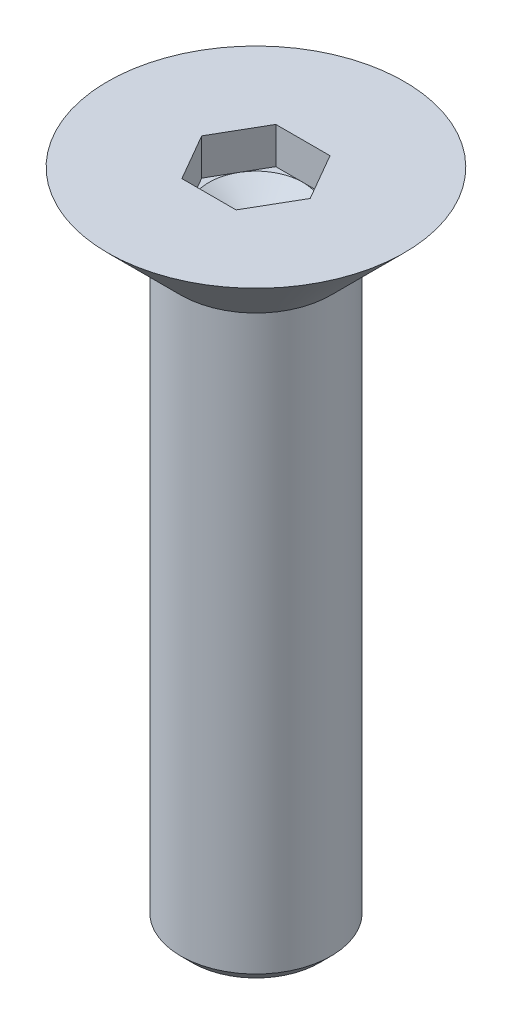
from build123d import *

# Parameters (mm, degrees)
ESQUISSE2_R             = 4
BASE_EXTRUSION_DEPTH    = 35
CHANFREIN1_SIZE         = 0.625
ESQUISSE7_R             = 2.5
ENL_V_MAT_EXTRU_2_DEPTH = 1.95
ENL_V_MAT_EXTRU_4_DEPTH = 1.95


with BuildPart() as part:
    # Esquisse2 → Base-Extrusion (new body)
    with BuildSketch(Plane(origin=(0, 0, 0), x_dir=(1, 0, 0), z_dir=(0, 1, 0))):
        with Locations(Location((0, 0, 0), (0, 0, 270))):
            Circle(ESQUISSE2_R)
    extrude(amount=-BASE_EXTRUSION_DEPTH)

    # Chanfrein1
    chanfrein1_edges = [part.edges().sort_by_distance(p)[0] for p in [
        (0, -35, -4),
    ]]
    chamfer(chanfrein1_edges, length=CHANFREIN1_SIZE)

    # Esquisse5 → Boss.-R_vol.1 (revolve)
    with BuildSketch(Plane.XY, mode=Mode.PRIVATE) as boss_r_vol_1_sk:
        Polygon((0, 0), (7.9, 0), (4, -3.9), (0, -3.9), align=None)
    revolve(boss_r_vol_1_sk.sketch.rotate(Axis((0, 0, 0), (0, -1, 0)), 90), axis=Axis((0, 0, 0), (0, -1, 0)))

    # Esquisse7 → Enl_v. mat.-Extru.2 (cut)
    with BuildSketch(Plane(origin=(0, 0, 0), x_dir=(-1, 0, 0), z_dir=(0, 1, 0))):
        Circle(ESQUISSE7_R)
    extrude(amount=-ENL_V_MAT_EXTRU_2_DEPTH, mode=Mode.SUBTRACT)

    # Enl_v. mat.-Extru.3 cone 1 section (on through the dimple's axis) → Enl_v. mat.-Extru.3 (revolve, cut)
    with BuildSketch(Plane(origin=(0, -1.95, 0), x_dir=(0, 0, 1), z_dir=(1, 0, 0))):
        Polygon((0, 0), (2.5, 0), (0, 1.443375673), align=None)
    revolve(axis=Axis((0, -1.95, 0), (0, -1, 0)), mode=Mode.SUBTRACT)

    # Esquisse9 → Enl_v. mat.-Extru.4 (cut)
    with BuildSketch(Plane(origin=(0, 0, 0), x_dir=(-1, 0, 0), z_dir=(0, 1, 0))):
        Polygon((1.443375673, 2.5), (-1.443375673, 2.5), (-2.886751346, 0), (-1.443375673, -2.5), (1.443375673, -2.5), (2.886751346, 0), align=None)
    extrude(amount=-ENL_V_MAT_EXTRU_4_DEPTH, mode=Mode.SUBTRACT)


solid = part.part
